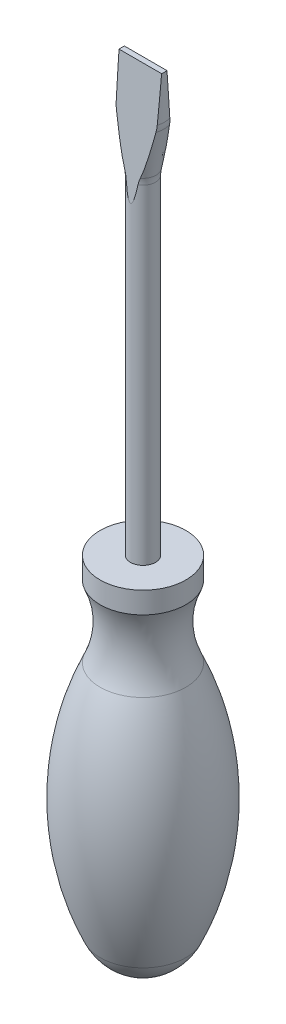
from build123d import *

# Parameters (mm, degrees)
BOSS_EXTRUDE2_DEPTH     = 1.5
CUT_EXTRUDE4_DEPTH      = 10
CUT_EXTRUDE5_DEPTH      = 222.63941018
CUT_EXTRUDE5_DEPTH_BACK = 222.63941018


with BuildPart() as part:
    # Handle → Revolve1 (revolve)
    with BuildSketch(Plane(origin=(0, 0, 0), x_dir=(0, 0, -1), z_dir=(1, 0, 0)), mode=Mode.PRIVATE) as revolve1_sk:
        with BuildLine():
            Line((12, 100), (12, 94))
            ThreePointArc((12, 94), (9.854452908, 84), (12, 74))
            ThreePointArc((12, 74), (19.026666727, 41.25), (12, 8.5))
            ThreePointArc((12, 8.5), (7.157479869, 2.615910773), (0, 0))
            Line((0, 0), (0, 100))
            Line((0, 100), (12, 100))
        make_face()
    revolve(revolve1_sk.sketch.rotate(Axis((0, 100, 0), (0, -1, 0)), 180), axis=Axis((0, 100, 0), (0, -1, 0)))

    # Sketch14 → Cut-Extrude5 (cut, two sides: drawn at the far end of the back side and taken through both)
    with BuildSketch(Plane(origin=(0, 0, 0), x_dir=(0, 0, -1), z_dir=(1, 0, 0)).offset(-CUT_EXTRUDE5_DEPTH_BACK)):
        with BuildLine():
            Line((20.646589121, 27), (20.646589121, 62.5))
            Line((20.646589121, 62.5), (16.146589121, 62.5))
            ThreePointArc((16.146589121, 62.5), (16.156571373, 44.714393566), (17.746589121, 27))
            Line((17.746589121, 27), (20.646589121, 27))
        make_face()
    extrude(amount=CUT_EXTRUDE5_DEPTH + CUT_EXTRUDE5_DEPTH_BACK, mode=Mode.SUBTRACT)


with BuildPart() as body_2:
    # Sketch4 → Revolve2 (revolve)
    with BuildSketch(Plane(origin=(0, 0, 0), x_dir=(0, 0, -1), z_dir=(1, 0, 0))):
        with BuildLine():
            Line((3.5, 192.114149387), (3.5, 30))
            Line((3.5, 30), (0, 30))
            Line((0, 30), (0, 220))
            Line((0, 220), (6, 220))
            Line((6, 220), (6, 207.885850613))
            ThreePointArc((6, 207.885850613), (5.960992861, 207.00345545), (5.844275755, 206.127944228))
            Line((5.844275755, 206.127944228), (3.655724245, 193.872055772))
            ThreePointArc((3.655724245, 193.872055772), (3.539007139, 192.99654455), (3.5, 192.114149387))
        make_face()
    revolve(axis=Axis((0, 30, 0), (0, 1, 0)))

    # Sketch5 → Boss-Extrude2 (add, symmetric)
    with BuildSketch(Plane.XY):
        Polygon((3.5, 80), (7.5, 75), (7.5, 65), (3.5, 60), (-3.5, 60), (-7.5, 65), (-7.5, 75), (-3.5, 80), align=None)
    extrude(amount=BOSS_EXTRUDE2_DEPTH, both=True)

    # Sketch11 → Cut-Extrude4 (cut, symmetric)
    with BuildSketch(Plane(origin=(0, 0, 0), x_dir=(0, 0, -1), z_dir=(1, 0, 0))):
        Polygon((10.893018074, 187), (3.5, 187), (0.75, 220), (10.893018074, 220), align=None)
        Polygon((-0.75, 220), (-3.5, 187), (-10.893018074, 187), (-10.893018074, 220), align=None)
    extrude(amount=CUT_EXTRUDE4_DEPTH, both=True, mode=Mode.SUBTRACT)


solid = Compound([part.part, body_2.part])
